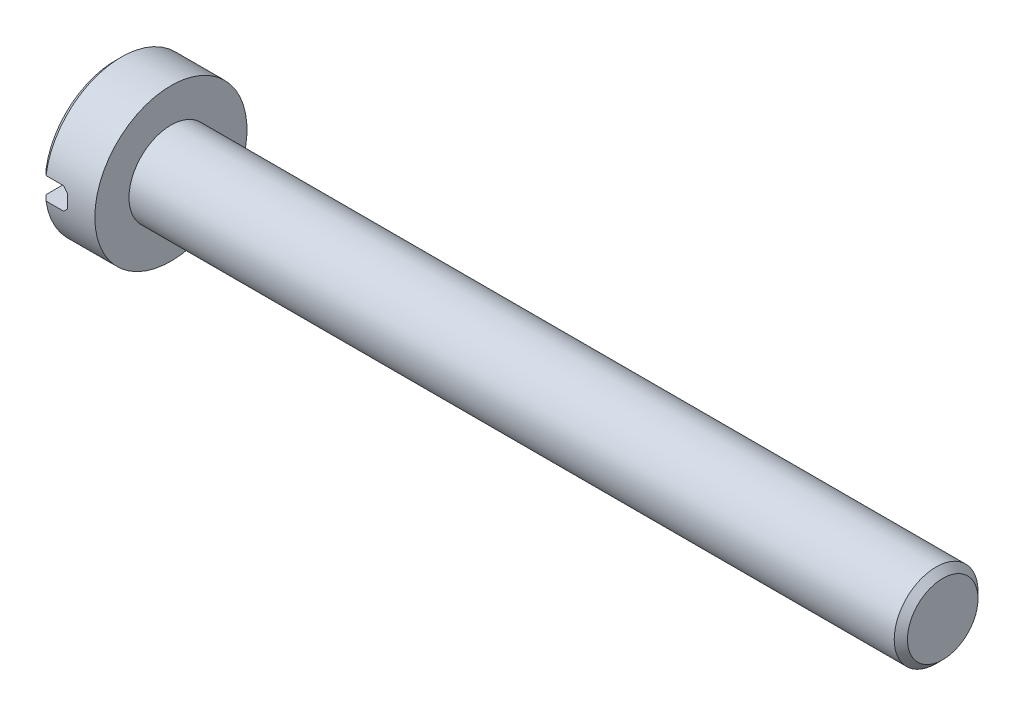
ISO-10303-21;
HEADER;
FILE_DESCRIPTION(('STEP AP214'),'2;1');
FILE_NAME('part.step','',(''),(''),'','','');
FILE_SCHEMA(('AUTOMOTIVE_DESIGN { 1 0 10303 214 1 1 1 1 }'));
ENDSEC;
DATA;
#1=APPLICATION_CONTEXT('core data for automotive mechanical design processes');
#2=APPLICATION_PROTOCOL_DEFINITION('international standard','automotive_design',2000,#1);
#3=PRODUCT_CONTEXT('',#1,'mechanical');
#4=PRODUCT('Part','Part','',(#3));
#5=PRODUCT_RELATED_PRODUCT_CATEGORY('part','',(#4));
#6=PRODUCT_DEFINITION_FORMATION('','',#4);
#7=PRODUCT_DEFINITION_CONTEXT('part definition',#1,'design');
#8=PRODUCT_DEFINITION('design','',#6,#7);
#9=PRODUCT_DEFINITION_SHAPE('','',#8);
#10=(LENGTH_UNIT() NAMED_UNIT(*) SI_UNIT(.MILLI.,.METRE.));
#11=(NAMED_UNIT(*) PLANE_ANGLE_UNIT() SI_UNIT($,.RADIAN.));
#12=(NAMED_UNIT(*) SI_UNIT($,.STERADIAN.) SOLID_ANGLE_UNIT());
#13=UNCERTAINTY_MEASURE_WITH_UNIT(LENGTH_MEASURE(1.E-05),#10,'distance_accuracy_value','');
#14=(GEOMETRIC_REPRESENTATION_CONTEXT(3) GLOBAL_UNCERTAINTY_ASSIGNED_CONTEXT((#13)) GLOBAL_UNIT_ASSIGNED_CONTEXT((#10,
#11,#12)) REPRESENTATION_CONTEXT('',''));
#15=CARTESIAN_POINT('',(0.,0.,0.));
#16=DIRECTION('',(0.,0.,1.));
#17=DIRECTION('',(1.,0.,0.));
#18=AXIS2_PLACEMENT_3D('',#15,#16,#17);
#19=CARTESIAN_POINT('',(2.5,3.45,0.));
#20=DIRECTION('',(-1.,0.,0.));
#21=DIRECTION('',(0.,0.,1.));
#22=AXIS2_PLACEMENT_3D('',#19,#20,#21);
#23=PLANE('',#22);
#24=CARTESIAN_POINT('',(2.5,0.,0.));
#25=DIRECTION('',(-1.,0.,0.));
#26=DIRECTION('',(0.,0.,1.));
#27=AXIS2_PLACEMENT_3D('',#24,#25,#26);
#28=CIRCLE('',#27,3.45);
#29=CARTESIAN_POINT('',(2.5,0.,3.45));
#30=VERTEX_POINT('',#29);
#31=EDGE_CURVE('E111',#30,#30,#28,.T.);
#32=ORIENTED_EDGE('',*,*,#31,.F.);
#33=EDGE_LOOP('',(#32));
#34=FACE_BOUND('',#33,.T.);
#35=CARTESIAN_POINT('',(2.5,0.,0.));
#36=DIRECTION('',(-1.,0.,0.));
#37=DIRECTION('',(0.,0.,1.));
#38=AXIS2_PLACEMENT_3D('',#35,#36,#37);
#39=CIRCLE('',#38,1.9);
#40=CARTESIAN_POINT('',(2.5,0.,1.9));
#41=VERTEX_POINT('',#40);
#42=EDGE_CURVE('E150',#41,#41,#39,.F.);
#43=ORIENTED_EDGE('',*,*,#42,.F.);
#44=EDGE_LOOP('',(#43));
#45=FACE_BOUND('',#44,.T.);
#46=ADVANCED_FACE('F37',(#34,#45),#23,.F.);
#47=CARTESIAN_POINT('',(0.25,0.,0.));
#48=DIRECTION('',(1.,0.,0.));
#49=DIRECTION('',(0.,0.,-1.));
#50=AXIS2_PLACEMENT_3D('',#47,#48,#49);
#51=CONICAL_SURFACE('',#50,3.45,0.785398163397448);
#52=CARTESIAN_POINT('',(0.25,0.,0.));
#53=DIRECTION('',(-1.,0.,0.));
#54=DIRECTION('',(0.,0.,1.));
#55=AXIS2_PLACEMENT_3D('',#52,#53,#54);
#56=CIRCLE('',#55,3.45);
#57=CARTESIAN_POINT('',(0.250000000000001,0.5,3.41357583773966));
#58=VERTEX_POINT('',#57);
#59=CARTESIAN_POINT('',(0.25,0.5,-3.41357583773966));
#60=VERTEX_POINT('',#59);
#61=EDGE_CURVE('E132',#58,#60,#56,.T.);
#62=ORIENTED_EDGE('',*,*,#61,.T.);
#63=CARTESIAN_POINT('',(4.39291650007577,0.5,-7.57643590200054));
#64=CARTESIAN_POINT('',(4.13255309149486,0.5,-7.3155016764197));
#65=CARTESIAN_POINT('',(3.87221468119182,0.5,-7.05454249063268));
#66=CARTESIAN_POINT('',(3.35161462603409,0.5,-6.5325368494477));
#67=CARTESIAN_POINT('',(3.09135298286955,0.5,-6.2714903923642));
#68=CARTESIAN_POINT('',(2.57082273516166,0.5,-5.74916196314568));
#69=CARTESIAN_POINT('',(2.31055418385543,0.5,-5.48787993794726));
#70=CARTESIAN_POINT('',(1.79019702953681,0.5,-4.96514718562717));
#71=CARTESIAN_POINT('',(1.5301084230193,0.5,-4.7036964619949));
#72=CARTESIAN_POINT('',(1.00746452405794,0.5,-4.17775672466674));
#73=CARTESIAN_POINT('',(0.744912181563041,0.5,-3.91326477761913));
#74=CARTESIAN_POINT('',(0.3514628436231,0.5,-3.5161347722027));
#75=CARTESIAN_POINT('',(0.220372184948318,0.5,-3.38368862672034));
#76=CARTESIAN_POINT('',(-0.0416230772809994,0.5,-3.11861402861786));
#77=CARTESIAN_POINT('',(-0.172527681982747,0.5,-2.98598557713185));
#78=CARTESIAN_POINT('',(-0.434028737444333,0.5,-2.72050095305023));
#79=CARTESIAN_POINT('',(-0.56462526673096,0.5,-2.58764485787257));
#80=CARTESIAN_POINT('',(-0.825399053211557,0.5,-2.32151559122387));
#81=CARTESIAN_POINT('',(-0.955576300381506,0.5,-2.18824240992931));
#82=CARTESIAN_POINT('',(-1.21522205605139,0.5,-1.92103326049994));
#83=CARTESIAN_POINT('',(-1.34469064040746,0.5,-1.78709736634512));
#84=CARTESIAN_POINT('',(-1.53789016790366,0.5,-1.58523735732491));
#85=CARTESIAN_POINT('',(-1.60212155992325,0.5,-1.51779263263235));
#86=CARTESIAN_POINT('',(-1.73008985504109,0.5,-1.38243611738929));
#87=CARTESIAN_POINT('',(-1.79382676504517,0.5,-1.31452433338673));
#88=CARTESIAN_POINT('',(-1.89156883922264,0.5,-1.20920633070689));
#89=CARTESIAN_POINT('',(-1.92584308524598,0.5,-1.17205005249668));
#90=CARTESIAN_POINT('',(-1.99409621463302,0.5,-1.09746555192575));
#91=CARTESIAN_POINT('',(-2.02807509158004,0.5,-1.06003732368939));
#92=CARTESIAN_POINT('',(-2.09563636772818,0.5,-0.98483174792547));
#93=CARTESIAN_POINT('',(-2.12921881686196,0.5,-0.947054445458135));
#94=CARTESIAN_POINT('',(-2.1958341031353,0.5,-0.871022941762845));
#95=CARTESIAN_POINT('',(-2.22886696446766,0.5,-0.832768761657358));
#96=CARTESIAN_POINT('',(-2.31035631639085,0.5,-0.736502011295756));
#97=CARTESIAN_POINT('',(-2.35834849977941,0.5,-0.67808764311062));
#98=CARTESIAN_POINT('',(-2.42795201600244,0.5,-0.588559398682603));
#99=CARTESIAN_POINT('',(-2.45076540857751,0.5,-0.558384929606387));
#100=CARTESIAN_POINT('',(-2.49520215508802,0.5,-0.497176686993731));
#101=CARTESIAN_POINT('',(-2.51682583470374,0.5,-0.46614315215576));
#102=CARTESIAN_POINT('',(-2.56271097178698,0.5,-0.396209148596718));
#103=CARTESIAN_POINT('',(-2.58656120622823,0.5,-0.357034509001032));
#104=CARTESIAN_POINT('',(-2.62978771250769,0.5,-0.276234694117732));
#105=CARTESIAN_POINT('',(-2.64917216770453,0.5,-0.234614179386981));
#106=CARTESIAN_POINT('',(-2.67502865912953,0.5,-0.16227275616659));
#107=CARTESIAN_POINT('',(-2.68364842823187,0.5,-0.132350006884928));
#108=CARTESIAN_POINT('',(-2.69577934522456,0.5,-0.0715316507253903));
#109=CARTESIAN_POINT('',(-2.69930841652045,0.5,-0.0406398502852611));
#110=CARTESIAN_POINT('',(-2.70050693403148,0.5,0.0214216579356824));
#111=CARTESIAN_POINT('',(-2.6981466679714,0.5,0.0525919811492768));
#112=CARTESIAN_POINT('',(-2.68805906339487,0.5,0.114077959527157));
#113=CARTESIAN_POINT('',(-2.6803173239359,0.5,0.144391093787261));
#114=CARTESIAN_POINT('',(-2.66052035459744,0.5,0.204644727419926));
#115=CARTESIAN_POINT('',(-2.64832849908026,0.5,0.23453820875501));
#116=CARTESIAN_POINT('',(-2.62105438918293,0.5,0.292998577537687));
#117=CARTESIAN_POINT('',(-2.60596690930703,0.5,0.321562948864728));
#118=CARTESIAN_POINT('',(-2.57374228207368,0.5,0.377800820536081));
#119=CARTESIAN_POINT('',(-2.55658939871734,0.5,0.40546513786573));
#120=CARTESIAN_POINT('',(-2.52097239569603,0.5,0.459891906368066));
#121=CARTESIAN_POINT('',(-2.50250940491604,0.5,0.486655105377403));
#122=CARTESIAN_POINT('',(-2.46302790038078,0.5,0.54178340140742));
#123=CARTESIAN_POINT('',(-2.44192613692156,0.5,0.570088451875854));
#124=CARTESIAN_POINT('',(-2.39894630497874,0.5,0.626104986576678));
#125=CARTESIAN_POINT('',(-2.37706813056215,0.5,0.653816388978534));
#126=CARTESIAN_POINT('',(-2.31057790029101,0.5,0.736303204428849));
#127=CARTESIAN_POINT('',(-2.26513078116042,0.5,0.790403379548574));
#128=CARTESIAN_POINT('',(-2.17288996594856,0.5,0.897602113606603));
#129=CARTESIAN_POINT('',(-2.12609394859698,0.5,0.950698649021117));
#130=CARTESIAN_POINT('',(-2.03170833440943,0.5,1.05615226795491));
#131=CARTESIAN_POINT('',(-1.98411897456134,0.5,1.108509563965));
#132=CARTESIAN_POINT('',(-1.88854640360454,0.5,1.21257214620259));
#133=CARTESIAN_POINT('',(-1.84056480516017,0.5,1.26427891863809));
#134=CARTESIAN_POINT('',(-1.74422055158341,0.5,1.36734291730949));
#135=CARTESIAN_POINT('',(-1.69585786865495,0.5,1.41870011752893));
#136=CARTESIAN_POINT('',(-1.55047241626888,0.5,1.57227221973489));
#137=CARTESIAN_POINT('',(-1.45304483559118,0.5,1.6741035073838));
#138=CARTESIAN_POINT('',(-1.25803664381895,0.5,1.87668795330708));
#139=CARTESIAN_POINT('',(-1.16045895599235,0.5,1.9774439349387));
#140=CARTESIAN_POINT('',(-0.964909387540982,0.5,2.1785728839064));
#141=CARTESIAN_POINT('',(-0.866937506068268,0.5,2.27894585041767));
#142=CARTESIAN_POINT('',(-0.572630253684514,0.5,2.57968950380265));
#143=CARTESIAN_POINT('',(-0.375907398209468,0.5,2.77968068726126));
#144=CARTESIAN_POINT('',(0.0181471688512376,0.5,3.17923376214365));
#145=CARTESIAN_POINT('',(0.215479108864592,0.5,3.37879542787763));
#146=CARTESIAN_POINT('',(0.610453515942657,0.5,3.77760746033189));
#147=CARTESIAN_POINT('',(0.808095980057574,0.5,3.97685782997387));
#148=CARTESIAN_POINT('',(1.20355940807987,0.5,4.37514470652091));
#149=CARTESIAN_POINT('',(1.40138035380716,0.5,4.57418123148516));
#150=CARTESIAN_POINT('',(1.79715625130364,0.5,4.97212197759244));
#151=CARTESIAN_POINT('',(1.9951112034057,0.5,5.1710261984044));
#152=CARTESIAN_POINT('',(2.58907097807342,0.5,5.76755760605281));
#153=CARTESIAN_POINT('',(2.98521404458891,0.5,6.16504713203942));
#154=CARTESIAN_POINT('',(3.55000354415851,0.5,6.73147105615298));
#155=CARTESIAN_POINT('',(3.71856805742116,0.5,6.9004871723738));
#156=CARTESIAN_POINT('',(4.05572314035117,0.5,7.23848488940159));
#157=CARTESIAN_POINT('',(4.22431370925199,0.5,7.40746649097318));
#158=CARTESIAN_POINT('',(4.39291650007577,0.5,7.57643590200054));
#159=B_SPLINE_CURVE_WITH_KNOTS('',3,(#63,#64,#65,#66,#67,#68,#69,#70,#71,#72,#73,#74,#75,#76,
#77,#78,#79,#80,#81,#82,#83,#84,#85,#86,#87,#88,#89,#90,#91,#92,#93,#94,#95,#96,#97,#98,#99,
#100,#101,#102,#103,#104,#105,#106,#107,#108,#109,#110,#111,#112,#113,#114,#115,#116,#117,#118,
#119,#120,#121,#122,#123,#124,#125,#126,#127,#128,#129,#130,#131,#132,#133,#134,#135,#136,#137,
#138,#139,#140,#141,#142,#143,#144,#145,#146,#147,#148,#149,#150,#151,#152,#153,#154,#155,#156,
#157,#158),.UNSPECIFIED.,.F.,.F.,(4,2,2,2,2,2,2,2,2,2,2,2,2,2,2,2,2,2,2,2,2,2,2,2,2,2,2,2,2,2,2,
2,2,2,2,2,2,2,2,2,2,2,2,2,2,2,2,4),(0.,1.1058399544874,2.21170266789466,3.31808054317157,
4.42443622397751,5.54247309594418,6.10152634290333,6.66057612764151,7.21946337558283,
7.77836388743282,8.33720335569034,8.61661234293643,8.89601742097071,9.04766647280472,
9.19931881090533,9.35095183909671,9.50257817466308,9.72930451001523,9.84276933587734,
9.95620294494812,10.093659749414,10.2308626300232,10.3239513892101,10.4167115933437,
10.5099407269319,10.6034203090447,10.7000514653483,10.7968586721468,10.8944566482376,
10.9919715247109,11.0978684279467,11.2037798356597,11.4157065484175,11.6280227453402,
11.8402766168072,12.0518928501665,12.2635246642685,12.6863143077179,13.1070964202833,
13.5278794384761,14.3694632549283,15.2114147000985,16.0533581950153,16.8952238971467,
17.7370916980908,19.4206429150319,20.1367602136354,20.8528594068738),.UNSPECIFIED.);
#160=CARTESIAN_POINT('',(0.,0.5,-3.16069612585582));
#161=VERTEX_POINT('',#160);
#162=EDGE_CURVE('E128',#60,#161,#159,.T.);
#163=ORIENTED_EDGE('',*,*,#162,.T.);
#164=CARTESIAN_POINT('',(0.,0.,0.));
#165=DIRECTION('',(-1.,0.,0.));
#166=DIRECTION('',(0.,0.,1.));
#167=AXIS2_PLACEMENT_3D('',#164,#165,#166);
#168=CIRCLE('',#167,3.2);
#169=CARTESIAN_POINT('',(0.,0.5,3.16069612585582));
#170=VERTEX_POINT('',#169);
#171=EDGE_CURVE('E123',#170,#161,#168,.T.);
#172=ORIENTED_EDGE('',*,*,#171,.F.);
#173=EDGE_CURVE('E191',#170,#58,#159,.T.);
#174=ORIENTED_EDGE('',*,*,#173,.T.);
#175=EDGE_LOOP('',(#62,#163,#172,#174));
#176=FACE_BOUND('',#175,.T.);
#177=ADVANCED_FACE('F166',(#176),#51,.T.);
#178=CARTESIAN_POINT('',(0.,0.,0.));
#179=DIRECTION('',(1.,0.,0.));
#180=DIRECTION('',(0.,0.,-1.));
#181=AXIS2_PLACEMENT_3D('',#178,#179,#180);
#182=PLANE('',#181);
#183=ORIENTED_EDGE('',*,*,#171,.T.);
#184=DIRECTION('',(0.,0.,1.));
#185=VECTOR('',#184,1.);
#186=CARTESIAN_POINT('',(0.,0.5,0.));
#187=LINE('',#186,#185);
#188=EDGE_CURVE('E110',#161,#170,#187,.T.);
#189=ORIENTED_EDGE('',*,*,#188,.T.);
#190=EDGE_LOOP('',(#183,#189));
#191=FACE_BOUND('',#190,.T.);
#192=ADVANCED_FACE('F171',(#191),#182,.F.);
#193=CARTESIAN_POINT('',(0.,0.,0.));
#194=DIRECTION('',(-1.,0.,0.));
#195=DIRECTION('',(0.,0.,1.));
#196=AXIS2_PLACEMENT_3D('',#193,#194,#195);
#197=CYLINDRICAL_SURFACE('',#196,3.45);
#198=ORIENTED_EDGE('',*,*,#61,.F.);
#199=DIRECTION('',(-1.,0.,0.));
#200=VECTOR('',#199,1.);
#201=CARTESIAN_POINT('',(0.,0.5,3.41357583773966));
#202=LINE('',#201,#200);
#203=CARTESIAN_POINT('',(1.05,0.5,3.41357583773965));
#204=VERTEX_POINT('',#203);
#205=EDGE_CURVE('E198',#58,#204,#202,.F.);
#206=ORIENTED_EDGE('',*,*,#205,.T.);
#207=CARTESIAN_POINT('',(1.55,0.,0.));
#208=DIRECTION('',(0.707106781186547,0.707106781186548,0.));
#209=DIRECTION('',(-0.707106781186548,0.707106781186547,0.));
#210=AXIS2_PLACEMENT_3D('',#207,#208,#209);
#211=ELLIPSE('',#210,4.87903679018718,3.45);
#212=CARTESIAN_POINT('',(1.25,0.3,3.43693177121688));
#213=VERTEX_POINT('',#212);
#214=EDGE_CURVE('E149',#204,#213,#211,.T.);
#215=ORIENTED_EDGE('',*,*,#214,.T.);
#216=CARTESIAN_POINT('',(1.25,0.,0.));
#217=DIRECTION('',(1.,0.,0.));
#218=DIRECTION('',(0.,0.,-1.));
#219=AXIS2_PLACEMENT_3D('',#216,#217,#218);
#220=CIRCLE('',#219,3.45);
#221=CARTESIAN_POINT('',(1.25,-0.3,3.43693177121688));
#222=VERTEX_POINT('',#221);
#223=EDGE_CURVE('E60',#213,#222,#220,.T.);
#224=ORIENTED_EDGE('',*,*,#223,.T.);
#225=CARTESIAN_POINT('',(1.55,0.,0.));
#226=DIRECTION('',(0.707106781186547,-0.707106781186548,0.));
#227=DIRECTION('',(-0.707106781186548,-0.707106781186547,0.));
#228=AXIS2_PLACEMENT_3D('',#225,#226,#227);
#229=ELLIPSE('',#228,4.87903679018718,3.45);
#230=CARTESIAN_POINT('',(1.05,-0.5,3.41357583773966));
#231=VERTEX_POINT('',#230);
#232=EDGE_CURVE('E143',#222,#231,#229,.T.);
#233=ORIENTED_EDGE('',*,*,#232,.T.);
#234=DIRECTION('',(-1.,0.,0.));
#235=VECTOR('',#234,1.);
#236=CARTESIAN_POINT('',(0.,-0.5,3.41357583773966));
#237=LINE('',#236,#235);
#238=CARTESIAN_POINT('',(0.25,-0.5,3.41357583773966));
#239=VERTEX_POINT('',#238);
#240=EDGE_CURVE('E119',#231,#239,#237,.T.);
#241=ORIENTED_EDGE('',*,*,#240,.T.);
#242=CARTESIAN_POINT('',(0.250000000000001,-0.5,-3.41357583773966));
#243=VERTEX_POINT('',#242);
#244=EDGE_CURVE('E118',#243,#239,#56,.T.);
#245=ORIENTED_EDGE('',*,*,#244,.F.);
#246=DIRECTION('',(-1.,0.,0.));
#247=VECTOR('',#246,1.);
#248=CARTESIAN_POINT('',(0.,-0.5,-3.41357583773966));
#249=LINE('',#248,#247);
#250=CARTESIAN_POINT('',(1.05,-0.5,-3.41357583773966));
#251=VERTEX_POINT('',#250);
#252=EDGE_CURVE('E120',#243,#251,#249,.F.);
#253=ORIENTED_EDGE('',*,*,#252,.T.);
#254=CARTESIAN_POINT('',(1.25,-0.3,-3.43693177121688));
#255=VERTEX_POINT('',#254);
#256=EDGE_CURVE('E139',#251,#255,#229,.T.);
#257=ORIENTED_EDGE('',*,*,#256,.T.);
#258=CARTESIAN_POINT('',(1.25,0.3,-3.43693177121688));
#259=VERTEX_POINT('',#258);
#260=EDGE_CURVE('E142',#255,#259,#220,.T.);
#261=ORIENTED_EDGE('',*,*,#260,.T.);
#262=CARTESIAN_POINT('',(1.05,0.5,-3.41357583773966));
#263=VERTEX_POINT('',#262);
#264=EDGE_CURVE('E146',#259,#263,#211,.T.);
#265=ORIENTED_EDGE('',*,*,#264,.T.);
#266=DIRECTION('',(-1.,0.,0.));
#267=VECTOR('',#266,1.);
#268=CARTESIAN_POINT('',(0.,0.5,-3.41357583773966));
#269=LINE('',#268,#267);
#270=EDGE_CURVE('E124',#263,#60,#269,.T.);
#271=ORIENTED_EDGE('',*,*,#270,.T.);
#272=EDGE_LOOP('',(#198,#206,#215,#224,#233,#241,#245,#253,#257,#261,#265,#271));
#273=FACE_BOUND('',#272,.T.);
#274=ORIENTED_EDGE('',*,*,#31,.T.);
#275=EDGE_LOOP('',(#274));
#276=FACE_BOUND('',#275,.T.);
#277=ADVANCED_FACE('F177',(#273,#276),#197,.T.);
#278=ORIENTED_EDGE('',*,*,#244,.T.);
#279=CARTESIAN_POINT('',(4.39291650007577,-0.5,7.57643590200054));
#280=CARTESIAN_POINT('',(4.13255309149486,-0.5,7.3155016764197));
#281=CARTESIAN_POINT('',(3.87221468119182,-0.5,7.05454249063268));
#282=CARTESIAN_POINT('',(3.35161462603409,-0.5,6.5325368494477));
#283=CARTESIAN_POINT('',(3.09135298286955,-0.5,6.2714903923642));
#284=CARTESIAN_POINT('',(2.57082273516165,-0.5,5.74916196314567));
#285=CARTESIAN_POINT('',(2.31055418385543,-0.5,5.48787993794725));
#286=CARTESIAN_POINT('',(1.79019702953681,-0.5,4.96514718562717));
#287=CARTESIAN_POINT('',(1.5301084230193,-0.5,4.70369646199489));
#288=CARTESIAN_POINT('',(1.00746452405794,-0.5,4.17775672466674));
#289=CARTESIAN_POINT('',(0.74491218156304,-0.5,3.91326477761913));
#290=CARTESIAN_POINT('',(0.3514628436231,-0.5,3.5161347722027));
#291=CARTESIAN_POINT('',(0.220372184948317,-0.5,3.38368862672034));
#292=CARTESIAN_POINT('',(-0.0416230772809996,-0.5,3.11861402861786));
#293=CARTESIAN_POINT('',(-0.172527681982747,-0.5,2.98598557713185));
#294=CARTESIAN_POINT('',(-0.434028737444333,-0.5,2.72050095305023));
#295=CARTESIAN_POINT('',(-0.56462526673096,-0.5,2.58764485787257));
#296=CARTESIAN_POINT('',(-0.825399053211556,-0.5,2.32151559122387));
#297=CARTESIAN_POINT('',(-0.955576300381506,-0.5,2.18824240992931));
#298=CARTESIAN_POINT('',(-1.21522205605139,-0.5,1.92103326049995));
#299=CARTESIAN_POINT('',(-1.34469064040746,-0.5,1.78709736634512));
#300=CARTESIAN_POINT('',(-1.53789016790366,-0.5,1.58523735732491));
#301=CARTESIAN_POINT('',(-1.60212155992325,-0.5,1.51779263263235));
#302=CARTESIAN_POINT('',(-1.73008985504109,-0.5,1.3824361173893));
#303=CARTESIAN_POINT('',(-1.79382676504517,-0.5,1.31452433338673));
#304=CARTESIAN_POINT('',(-1.89156883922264,-0.5,1.20920633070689));
#305=CARTESIAN_POINT('',(-1.92584308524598,-0.5,1.17205005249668));
#306=CARTESIAN_POINT('',(-1.99409621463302,-0.5,1.09746555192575));
#307=CARTESIAN_POINT('',(-2.02807509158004,-0.5,1.06003732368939));
#308=CARTESIAN_POINT('',(-2.09563636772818,-0.5,0.984831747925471));
#309=CARTESIAN_POINT('',(-2.12921881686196,-0.5,0.947054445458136));
#310=CARTESIAN_POINT('',(-2.1958341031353,-0.5,0.871022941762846));
#311=CARTESIAN_POINT('',(-2.22886696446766,-0.5,0.832768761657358));
#312=CARTESIAN_POINT('',(-2.31035631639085,-0.5,0.736502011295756));
#313=CARTESIAN_POINT('',(-2.35834849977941,-0.5,0.678087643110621));
#314=CARTESIAN_POINT('',(-2.42795201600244,-0.5,0.588559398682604));
#315=CARTESIAN_POINT('',(-2.45076540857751,-0.5,0.558384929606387));
#316=CARTESIAN_POINT('',(-2.49520215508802,-0.5,0.497176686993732));
#317=CARTESIAN_POINT('',(-2.51682583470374,-0.5,0.466143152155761));
#318=CARTESIAN_POINT('',(-2.56271097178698,-0.5,0.396209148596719));
#319=CARTESIAN_POINT('',(-2.58656120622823,-0.5,0.357034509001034));
#320=CARTESIAN_POINT('',(-2.62978771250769,-0.5,0.276234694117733));
#321=CARTESIAN_POINT('',(-2.64917216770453,-0.5,0.234614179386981));
#322=CARTESIAN_POINT('',(-2.67502865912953,-0.5,0.16227275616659));
#323=CARTESIAN_POINT('',(-2.68364842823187,-0.5,0.132350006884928));
#324=CARTESIAN_POINT('',(-2.69577934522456,-0.5,0.0715316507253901));
#325=CARTESIAN_POINT('',(-2.69930841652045,-0.5,0.0406398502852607));
#326=CARTESIAN_POINT('',(-2.70050693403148,-0.5,-0.021421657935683));
#327=CARTESIAN_POINT('',(-2.6981466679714,-0.5,-0.0525919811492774));
#328=CARTESIAN_POINT('',(-2.68805906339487,-0.5,-0.114077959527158));
#329=CARTESIAN_POINT('',(-2.6803173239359,-0.5,-0.144391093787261));
#330=CARTESIAN_POINT('',(-2.66052035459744,-0.5,-0.204644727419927));
#331=CARTESIAN_POINT('',(-2.64832849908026,-0.5,-0.234538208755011));
#332=CARTESIAN_POINT('',(-2.62105438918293,-0.5,-0.292998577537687));
#333=CARTESIAN_POINT('',(-2.60596690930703,-0.5,-0.321562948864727));
#334=CARTESIAN_POINT('',(-2.57374228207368,-0.5,-0.37780082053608));
#335=CARTESIAN_POINT('',(-2.55658939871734,-0.5,-0.40546513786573));
#336=CARTESIAN_POINT('',(-2.52097239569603,-0.5,-0.459891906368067));
#337=CARTESIAN_POINT('',(-2.50250940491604,-0.5,-0.486655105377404));
#338=CARTESIAN_POINT('',(-2.46302790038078,-0.5,-0.541783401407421));
#339=CARTESIAN_POINT('',(-2.44192613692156,-0.5,-0.570088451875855));
#340=CARTESIAN_POINT('',(-2.39894630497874,-0.5,-0.626104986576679));
#341=CARTESIAN_POINT('',(-2.37706813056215,-0.5,-0.653816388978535));
#342=CARTESIAN_POINT('',(-2.31057790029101,-0.5,-0.73630320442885));
#343=CARTESIAN_POINT('',(-2.26513078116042,-0.5,-0.790403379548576));
#344=CARTESIAN_POINT('',(-2.17288996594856,-0.5,-0.897602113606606));
#345=CARTESIAN_POINT('',(-2.12609394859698,-0.5,-0.95069864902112));
#346=CARTESIAN_POINT('',(-2.03170833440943,-0.5,-1.05615226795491));
#347=CARTESIAN_POINT('',(-1.98411897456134,-0.5,-1.108509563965));
#348=CARTESIAN_POINT('',(-1.88854640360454,-0.5,-1.21257214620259));
#349=CARTESIAN_POINT('',(-1.84056480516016,-0.5,-1.26427891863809));
#350=CARTESIAN_POINT('',(-1.74422055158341,-0.5,-1.3673429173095));
#351=CARTESIAN_POINT('',(-1.69585786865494,-0.5,-1.41870011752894));
#352=CARTESIAN_POINT('',(-1.55047241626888,-0.5,-1.5722722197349));
#353=CARTESIAN_POINT('',(-1.45304483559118,-0.5,-1.67410350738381));
#354=CARTESIAN_POINT('',(-1.25803664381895,-0.5,-1.87668795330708));
#355=CARTESIAN_POINT('',(-1.16045895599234,-0.5,-1.97744393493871));
#356=CARTESIAN_POINT('',(-0.964909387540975,-0.5,-2.17857288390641));
#357=CARTESIAN_POINT('',(-0.86693750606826,-0.5,-2.27894585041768));
#358=CARTESIAN_POINT('',(-0.572630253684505,-0.5,-2.57968950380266));
#359=CARTESIAN_POINT('',(-0.375907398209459,-0.5,-2.77968068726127));
#360=CARTESIAN_POINT('',(0.0181471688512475,-0.5,-3.17923376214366));
#361=CARTESIAN_POINT('',(0.215479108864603,-0.5,-3.37879542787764));
#362=CARTESIAN_POINT('',(0.610453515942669,-0.5,-3.7776074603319));
#363=CARTESIAN_POINT('',(0.808095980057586,-0.5,-3.97685782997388));
#364=CARTESIAN_POINT('',(1.20355940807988,-0.5,-4.37514470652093));
#365=CARTESIAN_POINT('',(1.40138035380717,-0.5,-4.57418123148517));
#366=CARTESIAN_POINT('',(1.79715625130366,-0.5,-4.97212197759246));
#367=CARTESIAN_POINT('',(1.99511120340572,-0.5,-5.17102619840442));
#368=CARTESIAN_POINT('',(2.58907097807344,-0.5,-5.76755760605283));
#369=CARTESIAN_POINT('',(2.98521404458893,-0.5,-6.16504713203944));
#370=CARTESIAN_POINT('',(3.55000354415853,-0.5,-6.731471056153));
#371=CARTESIAN_POINT('',(3.71856805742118,-0.5,-6.90048717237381));
#372=CARTESIAN_POINT('',(4.05572314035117,-0.5,-7.2384848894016));
#373=CARTESIAN_POINT('',(4.224313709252,-0.5,-7.40746649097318));
#374=CARTESIAN_POINT('',(4.39291650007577,-0.5,-7.57643590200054));
#375=B_SPLINE_CURVE_WITH_KNOTS('',3,(#279,#280,#281,#282,#283,#284,#285,#286,#287,#288,#289,
#290,#291,#292,#293,#294,#295,#296,#297,#298,#299,#300,#301,#302,#303,#304,#305,#306,#307,#308,
#309,#310,#311,#312,#313,#314,#315,#316,#317,#318,#319,#320,#321,#322,#323,#324,#325,#326,#327,
#328,#329,#330,#331,#332,#333,#334,#335,#336,#337,#338,#339,#340,#341,#342,#343,#344,#345,#346,
#347,#348,#349,#350,#351,#352,#353,#354,#355,#356,#357,#358,#359,#360,#361,#362,#363,#364,#365,
#366,#367,#368,#369,#370,#371,#372,#373,#374),.UNSPECIFIED.,.F.,.F.,(4,2,2,2,2,2,2,2,2,2,2,2,2,
2,2,2,2,2,2,2,2,2,2,2,2,2,2,2,2,2,2,2,2,2,2,2,2,2,2,2,2,2,2,2,2,2,2,4),(0.,1.1058399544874,
2.21170266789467,3.31808054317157,4.42443622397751,5.54247309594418,6.10152634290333,
6.66057612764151,7.21946337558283,7.77836388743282,8.33720335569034,8.61661234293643,
8.89601742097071,9.04766647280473,9.19931881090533,9.35095183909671,9.50257817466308,
9.72930451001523,9.84276933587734,9.95620294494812,10.093659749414,10.2308626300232,
10.3239513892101,10.4167115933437,10.5099407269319,10.6034203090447,10.7000514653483,
10.7968586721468,10.8944566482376,10.9919715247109,11.0978684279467,11.2037798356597,
11.4157065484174,11.6280227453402,11.8402766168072,12.0518928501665,12.2635246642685,
12.6863143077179,13.1070964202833,13.5278794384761,14.3694632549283,15.2114147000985,
16.0533581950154,16.8952238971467,17.7370916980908,19.4206429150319,20.1367602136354,
20.8528594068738),.UNSPECIFIED.);
#376=CARTESIAN_POINT('',(0.,-0.5,3.16069612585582));
#377=VERTEX_POINT('',#376);
#378=EDGE_CURVE('E105',#239,#377,#375,.T.);
#379=ORIENTED_EDGE('',*,*,#378,.T.);
#380=CARTESIAN_POINT('',(0.,-0.5,-3.16069612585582));
#381=VERTEX_POINT('',#380);
#382=EDGE_CURVE('E116',#381,#377,#168,.T.);
#383=ORIENTED_EDGE('',*,*,#382,.F.);
#384=EDGE_CURVE('E52',#381,#243,#375,.T.);
#385=ORIENTED_EDGE('',*,*,#384,.T.);
#386=EDGE_LOOP('',(#278,#379,#383,#385));
#387=FACE_BOUND('',#386,.T.);
#388=ADVANCED_FACE('F115',(#387),#51,.T.);
#389=ORIENTED_EDGE('',*,*,#382,.T.);
#390=DIRECTION('',(0.,0.,-1.));
#391=VECTOR('',#390,1.);
#392=CARTESIAN_POINT('',(0.,-0.5,0.));
#393=LINE('',#392,#391);
#394=EDGE_CURVE('E101',#377,#381,#393,.T.);
#395=ORIENTED_EDGE('',*,*,#394,.T.);
#396=EDGE_LOOP('',(#389,#395));
#397=FACE_BOUND('',#396,.T.);
#398=ADVANCED_FACE('F122',(#397),#182,.F.);
#399=CARTESIAN_POINT('',(1.05,0.5,-5.));
#400=DIRECTION('',(0.707106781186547,0.707106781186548,0.));
#401=DIRECTION('',(-0.707106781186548,0.707106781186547,0.));
#402=AXIS2_PLACEMENT_3D('',#399,#400,#401);
#403=PLANE('',#402);
#404=DIRECTION('',(0.,0.,1.));
#405=VECTOR('',#404,1.);
#406=CARTESIAN_POINT('',(1.05,0.5,-5.));
#407=LINE('',#406,#405);
#408=EDGE_CURVE('E312',#263,#204,#407,.T.);
#409=ORIENTED_EDGE('',*,*,#408,.F.);
#410=ORIENTED_EDGE('',*,*,#264,.F.);
#411=DIRECTION('',(0.,0.,1.));
#412=VECTOR('',#411,1.);
#413=CARTESIAN_POINT('',(1.25,0.3,-5.));
#414=LINE('',#413,#412);
#415=EDGE_CURVE('E313',#259,#213,#414,.T.);
#416=ORIENTED_EDGE('',*,*,#415,.T.);
#417=ORIENTED_EDGE('',*,*,#214,.F.);
#418=EDGE_LOOP('',(#409,#410,#416,#417));
#419=FACE_BOUND('',#418,.T.);
#420=ADVANCED_FACE('F206',(#419),#403,.F.);
#421=CARTESIAN_POINT('',(1.25,0.3,-5.));
#422=DIRECTION('',(1.,0.,0.));
#423=DIRECTION('',(0.,0.,-1.));
#424=AXIS2_PLACEMENT_3D('',#421,#422,#423);
#425=PLANE('',#424);
#426=ORIENTED_EDGE('',*,*,#415,.F.);
#427=ORIENTED_EDGE('',*,*,#260,.F.);
#428=DIRECTION('',(0.,0.,1.));
#429=VECTOR('',#428,1.);
#430=CARTESIAN_POINT('',(1.25,-0.3,-5.));
#431=LINE('',#430,#429);
#432=EDGE_CURVE('E315',#255,#222,#431,.T.);
#433=ORIENTED_EDGE('',*,*,#432,.T.);
#434=ORIENTED_EDGE('',*,*,#223,.F.);
#435=EDGE_LOOP('',(#426,#427,#433,#434));
#436=FACE_BOUND('',#435,.T.);
#437=ADVANCED_FACE('F209',(#436),#425,.F.);
#438=CARTESIAN_POINT('',(1.05,-0.5,-5.));
#439=DIRECTION('',(0.707106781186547,-0.707106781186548,0.));
#440=DIRECTION('',(0.707106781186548,0.707106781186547,0.));
#441=AXIS2_PLACEMENT_3D('',#438,#439,#440);
#442=PLANE('',#441);
#443=DIRECTION('',(0.,0.,1.));
#444=VECTOR('',#443,1.);
#445=CARTESIAN_POINT('',(1.05,-0.5,-5.));
#446=LINE('',#445,#444);
#447=EDGE_CURVE('E318',#251,#231,#446,.T.);
#448=ORIENTED_EDGE('',*,*,#447,.T.);
#449=ORIENTED_EDGE('',*,*,#232,.F.);
#450=ORIENTED_EDGE('',*,*,#432,.F.);
#451=ORIENTED_EDGE('',*,*,#256,.F.);
#452=EDGE_LOOP('',(#448,#449,#450,#451));
#453=FACE_BOUND('',#452,.T.);
#454=ADVANCED_FACE('F204',(#453),#442,.F.);
#455=CARTESIAN_POINT('',(0.,0.5,-5.));
#456=DIRECTION('',(0.,1.,0.));
#457=DIRECTION('',(0.,0.,1.));
#458=AXIS2_PLACEMENT_3D('',#455,#456,#457);
#459=PLANE('',#458);
#460=ORIENTED_EDGE('',*,*,#408,.T.);
#461=ORIENTED_EDGE('',*,*,#205,.F.);
#462=ORIENTED_EDGE('',*,*,#173,.F.);
#463=ORIENTED_EDGE('',*,*,#188,.F.);
#464=ORIENTED_EDGE('',*,*,#162,.F.);
#465=ORIENTED_EDGE('',*,*,#270,.F.);
#466=EDGE_LOOP('',(#460,#461,#462,#463,#464,#465));
#467=FACE_BOUND('',#466,.T.);
#468=ADVANCED_FACE('F199',(#467),#459,.F.);
#469=CARTESIAN_POINT('',(0.,-0.5,-5.));
#470=DIRECTION('',(0.,-1.,0.));
#471=DIRECTION('',(0.,0.,-1.));
#472=AXIS2_PLACEMENT_3D('',#469,#470,#471);
#473=PLANE('',#472);
#474=ORIENTED_EDGE('',*,*,#447,.F.);
#475=ORIENTED_EDGE('',*,*,#252,.F.);
#476=ORIENTED_EDGE('',*,*,#384,.F.);
#477=ORIENTED_EDGE('',*,*,#394,.F.);
#478=ORIENTED_EDGE('',*,*,#378,.F.);
#479=ORIENTED_EDGE('',*,*,#240,.F.);
#480=EDGE_LOOP('',(#474,#475,#476,#477,#478,#479));
#481=FACE_BOUND('',#480,.T.);
#482=ADVANCED_FACE('F104',(#481),#473,.F.);
#483=CARTESIAN_POINT('',(37.5,0.,0.));
#484=DIRECTION('',(-1.,0.,0.));
#485=DIRECTION('',(0.,0.,1.));
#486=AXIS2_PLACEMENT_3D('',#483,#484,#485);
#487=CYLINDRICAL_SURFACE('',#486,1.9);
#488=CARTESIAN_POINT('',(37.2,0.,0.));
#489=DIRECTION('',(1.,0.,0.));
#490=DIRECTION('',(0.,0.,-1.));
#491=AXIS2_PLACEMENT_3D('',#488,#489,#490);
#492=CIRCLE('',#491,1.9);
#493=CARTESIAN_POINT('',(37.2,0.,-1.9));
#494=VERTEX_POINT('',#493);
#495=EDGE_CURVE('E11',#494,#494,#492,.F.);
#496=ORIENTED_EDGE('',*,*,#495,.T.);
#497=EDGE_LOOP('',(#496));
#498=FACE_BOUND('',#497,.T.);
#499=ORIENTED_EDGE('',*,*,#42,.T.);
#500=EDGE_LOOP('',(#499));
#501=FACE_BOUND('',#500,.T.);
#502=ADVANCED_FACE('F162',(#498,#501),#487,.T.);
#503=CARTESIAN_POINT('',(37.5,0.,0.));
#504=DIRECTION('',(1.,0.,0.));
#505=DIRECTION('',(0.,0.,-1.));
#506=AXIS2_PLACEMENT_3D('',#503,#504,#505);
#507=PLANE('',#506);
#508=CARTESIAN_POINT('',(37.5,0.,0.));
#509=DIRECTION('',(1.,0.,0.));
#510=DIRECTION('',(0.,0.,-1.));
#511=AXIS2_PLACEMENT_3D('',#508,#509,#510);
#512=CIRCLE('',#511,1.6);
#513=CARTESIAN_POINT('',(37.5,0.,-1.6));
#514=VERTEX_POINT('',#513);
#515=EDGE_CURVE('E45',#514,#514,#512,.T.);
#516=ORIENTED_EDGE('',*,*,#515,.T.);
#517=EDGE_LOOP('',(#516));
#518=FACE_BOUND('',#517,.T.);
#519=ADVANCED_FACE('F155',(#518),#507,.T.);
#520=CARTESIAN_POINT('',(37.5,0.,0.));
#521=DIRECTION('',(-1.,0.,0.));
#522=DIRECTION('',(0.,0.,1.));
#523=AXIS2_PLACEMENT_3D('',#520,#521,#522);
#524=CONICAL_SURFACE('',#523,1.6,0.785398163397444);
#525=ORIENTED_EDGE('',*,*,#495,.F.);
#526=EDGE_LOOP('',(#525));
#527=FACE_BOUND('',#526,.T.);
#528=ORIENTED_EDGE('',*,*,#515,.F.);
#529=EDGE_LOOP('',(#528));
#530=FACE_BOUND('',#529,.T.);
#531=ADVANCED_FACE('F39',(#527,#530),#524,.T.);
#532=CLOSED_SHELL('',(#46,#177,#192,#277,#388,#398,#420,#437,#454,#468,#482,#502,#519,#531));
#533=MANIFOLD_SOLID_BREP('B2',#532);
#534=ADVANCED_BREP_SHAPE_REPRESENTATION('',(#18,#533),#14);
#535=SHAPE_DEFINITION_REPRESENTATION(#9,#534);
ENDSEC;
END-ISO-10303-21;
